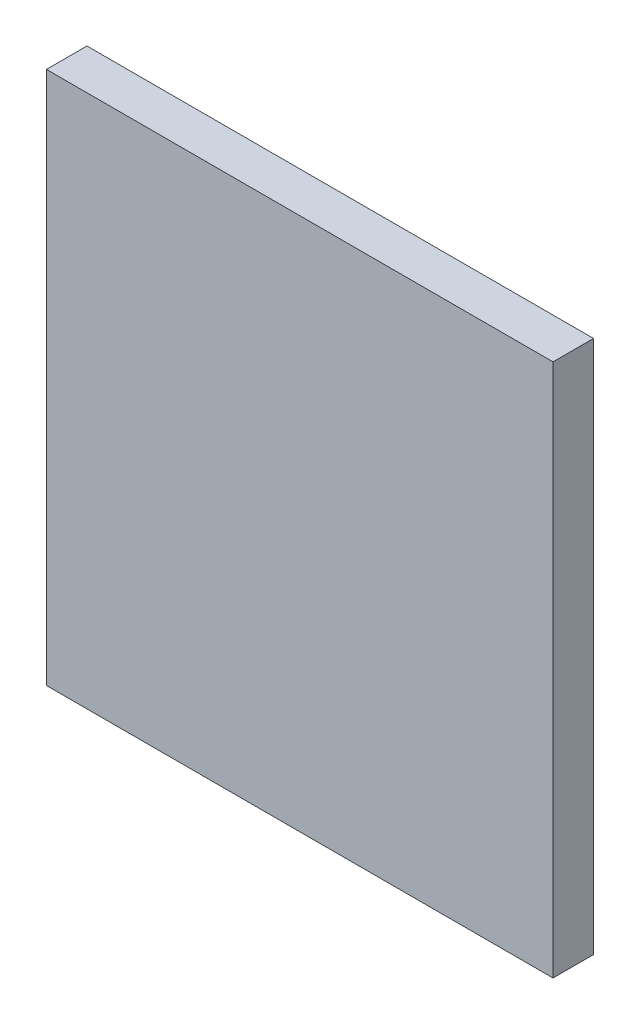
ISO-10303-21;
HEADER;
FILE_DESCRIPTION(('STEP AP214'),'2;1');
FILE_NAME('part.step','',(''),(''),'','','');
FILE_SCHEMA(('AUTOMOTIVE_DESIGN { 1 0 10303 214 1 1 1 1 }'));
ENDSEC;
DATA;
#1=APPLICATION_CONTEXT('core data for automotive mechanical design processes');
#2=APPLICATION_PROTOCOL_DEFINITION('international standard','automotive_design',2000,#1);
#3=PRODUCT_CONTEXT('',#1,'mechanical');
#4=PRODUCT('Part','Part','',(#3));
#5=PRODUCT_RELATED_PRODUCT_CATEGORY('part','',(#4));
#6=PRODUCT_DEFINITION_FORMATION('','',#4);
#7=PRODUCT_DEFINITION_CONTEXT('part definition',#1,'design');
#8=PRODUCT_DEFINITION('design','',#6,#7);
#9=PRODUCT_DEFINITION_SHAPE('','',#8);
#10=(LENGTH_UNIT() NAMED_UNIT(*) SI_UNIT(.MILLI.,.METRE.));
#11=(NAMED_UNIT(*) PLANE_ANGLE_UNIT() SI_UNIT($,.RADIAN.));
#12=(NAMED_UNIT(*) SI_UNIT($,.STERADIAN.) SOLID_ANGLE_UNIT());
#13=UNCERTAINTY_MEASURE_WITH_UNIT(LENGTH_MEASURE(1.E-05),#10,'distance_accuracy_value','');
#14=(GEOMETRIC_REPRESENTATION_CONTEXT(3) GLOBAL_UNCERTAINTY_ASSIGNED_CONTEXT((#13)) GLOBAL_UNIT_ASSIGNED_CONTEXT((#10,
#11,#12)) REPRESENTATION_CONTEXT('',''));
#15=CARTESIAN_POINT('',(0.,0.,0.));
#16=DIRECTION('',(0.,0.,1.));
#17=DIRECTION('',(1.,0.,0.));
#18=AXIS2_PLACEMENT_3D('',#15,#16,#17);
#19=CARTESIAN_POINT('',(0.,0.,12.));
#20=DIRECTION('',(0.,0.,1.));
#21=DIRECTION('',(1.,0.,0.));
#22=AXIS2_PLACEMENT_3D('',#19,#20,#21);
#23=PLANE('',#22);
#24=DIRECTION('',(1.,0.,0.));
#25=VECTOR('',#24,1.);
#26=CARTESIAN_POINT('',(-75.,-79.,12.));
#27=LINE('',#26,#25);
#28=CARTESIAN_POINT('',(-75.,-79.,12.));
#29=VERTEX_POINT('',#28);
#30=CARTESIAN_POINT('',(75.,-79.,12.));
#31=VERTEX_POINT('',#30);
#32=EDGE_CURVE('E81',#29,#31,#27,.T.);
#33=ORIENTED_EDGE('',*,*,#32,.T.);
#34=DIRECTION('',(0.,1.,0.));
#35=VECTOR('',#34,1.);
#36=CARTESIAN_POINT('',(75.,-79.,12.));
#37=LINE('',#36,#35);
#38=CARTESIAN_POINT('',(75.,79.,12.));
#39=VERTEX_POINT('',#38);
#40=EDGE_CURVE('E99',#31,#39,#37,.T.);
#41=ORIENTED_EDGE('',*,*,#40,.T.);
#42=DIRECTION('',(-1.,0.,0.));
#43=VECTOR('',#42,1.);
#44=CARTESIAN_POINT('',(75.,79.,12.));
#45=LINE('',#44,#43);
#46=CARTESIAN_POINT('',(-75.,79.,12.));
#47=VERTEX_POINT('',#46);
#48=EDGE_CURVE('E74',#39,#47,#45,.T.);
#49=ORIENTED_EDGE('',*,*,#48,.T.);
#50=DIRECTION('',(0.,-1.,0.));
#51=VECTOR('',#50,1.);
#52=CARTESIAN_POINT('',(-75.,79.,12.));
#53=LINE('',#52,#51);
#54=EDGE_CURVE('E10',#47,#29,#53,.T.);
#55=ORIENTED_EDGE('',*,*,#54,.T.);
#56=EDGE_LOOP('',(#33,#41,#49,#55));
#57=FACE_BOUND('',#56,.T.);
#58=ADVANCED_FACE('F16',(#57),#23,.T.);
#59=CARTESIAN_POINT('',(0.,0.,0.));
#60=DIRECTION('',(0.,0.,1.));
#61=DIRECTION('',(1.,0.,0.));
#62=AXIS2_PLACEMENT_3D('',#59,#60,#61);
#63=PLANE('',#62);
#64=DIRECTION('',(0.,-1.,0.));
#65=VECTOR('',#64,1.);
#66=CARTESIAN_POINT('',(-75.,79.,0.));
#67=LINE('',#66,#65);
#68=CARTESIAN_POINT('',(-75.,79.,0.));
#69=VERTEX_POINT('',#68);
#70=CARTESIAN_POINT('',(-75.,-79.,0.));
#71=VERTEX_POINT('',#70);
#72=EDGE_CURVE('E19',#69,#71,#67,.T.);
#73=ORIENTED_EDGE('',*,*,#72,.F.);
#74=DIRECTION('',(-1.,0.,0.));
#75=VECTOR('',#74,1.);
#76=CARTESIAN_POINT('',(75.,79.,0.));
#77=LINE('',#76,#75);
#78=CARTESIAN_POINT('',(75.,79.,0.));
#79=VERTEX_POINT('',#78);
#80=EDGE_CURVE('E103',#79,#69,#77,.T.);
#81=ORIENTED_EDGE('',*,*,#80,.F.);
#82=DIRECTION('',(0.,1.,0.));
#83=VECTOR('',#82,1.);
#84=CARTESIAN_POINT('',(75.,-79.,0.));
#85=LINE('',#84,#83);
#86=CARTESIAN_POINT('',(75.,-79.,0.));
#87=VERTEX_POINT('',#86);
#88=EDGE_CURVE('E83',#87,#79,#85,.T.);
#89=ORIENTED_EDGE('',*,*,#88,.F.);
#90=DIRECTION('',(1.,0.,0.));
#91=VECTOR('',#90,1.);
#92=CARTESIAN_POINT('',(-75.,-79.,0.));
#93=LINE('',#92,#91);
#94=EDGE_CURVE('E79',#71,#87,#93,.T.);
#95=ORIENTED_EDGE('',*,*,#94,.F.);
#96=EDGE_LOOP('',(#73,#81,#89,#95));
#97=FACE_BOUND('',#96,.T.);
#98=ADVANCED_FACE('F85',(#97),#63,.F.);
#99=CARTESIAN_POINT('',(-75.,79.,0.));
#100=DIRECTION('',(1.,0.,0.));
#101=DIRECTION('',(0.,1.,0.));
#102=AXIS2_PLACEMENT_3D('',#99,#100,#101);
#103=PLANE('',#102);
#104=ORIENTED_EDGE('',*,*,#72,.T.);
#105=DIRECTION('',(0.,0.,1.));
#106=VECTOR('',#105,1.);
#107=CARTESIAN_POINT('',(-75.,-79.,0.));
#108=LINE('',#107,#106);
#109=EDGE_CURVE('E68',#71,#29,#108,.T.);
#110=ORIENTED_EDGE('',*,*,#109,.T.);
#111=ORIENTED_EDGE('',*,*,#54,.F.);
#112=DIRECTION('',(0.,0.,1.));
#113=VECTOR('',#112,1.);
#114=CARTESIAN_POINT('',(-75.,79.,0.));
#115=LINE('',#114,#113);
#116=EDGE_CURVE('E71',#69,#47,#115,.T.);
#117=ORIENTED_EDGE('',*,*,#116,.F.);
#118=EDGE_LOOP('',(#104,#110,#111,#117));
#119=FACE_BOUND('',#118,.T.);
#120=ADVANCED_FACE('F67',(#119),#103,.F.);
#121=CARTESIAN_POINT('',(75.,79.,0.));
#122=DIRECTION('',(0.,-1.,0.));
#123=DIRECTION('',(0.,0.,-1.));
#124=AXIS2_PLACEMENT_3D('',#121,#122,#123);
#125=PLANE('',#124);
#126=ORIENTED_EDGE('',*,*,#80,.T.);
#127=ORIENTED_EDGE('',*,*,#116,.T.);
#128=ORIENTED_EDGE('',*,*,#48,.F.);
#129=DIRECTION('',(0.,0.,1.));
#130=VECTOR('',#129,1.);
#131=CARTESIAN_POINT('',(75.,79.,0.));
#132=LINE('',#131,#130);
#133=EDGE_CURVE('E104',#79,#39,#132,.T.);
#134=ORIENTED_EDGE('',*,*,#133,.F.);
#135=EDGE_LOOP('',(#126,#127,#128,#134));
#136=FACE_BOUND('',#135,.T.);
#137=ADVANCED_FACE('F116',(#136),#125,.F.);
#138=CARTESIAN_POINT('',(75.,-79.,0.));
#139=DIRECTION('',(-1.,0.,0.));
#140=DIRECTION('',(0.,0.,1.));
#141=AXIS2_PLACEMENT_3D('',#138,#139,#140);
#142=PLANE('',#141);
#143=ORIENTED_EDGE('',*,*,#88,.T.);
#144=ORIENTED_EDGE('',*,*,#133,.T.);
#145=ORIENTED_EDGE('',*,*,#40,.F.);
#146=DIRECTION('',(0.,0.,1.));
#147=VECTOR('',#146,1.);
#148=CARTESIAN_POINT('',(75.,-79.,0.));
#149=LINE('',#148,#147);
#150=EDGE_CURVE('E89',#87,#31,#149,.T.);
#151=ORIENTED_EDGE('',*,*,#150,.F.);
#152=EDGE_LOOP('',(#143,#144,#145,#151));
#153=FACE_BOUND('',#152,.T.);
#154=ADVANCED_FACE('F119',(#153),#142,.F.);
#155=CARTESIAN_POINT('',(-75.,-79.,0.));
#156=DIRECTION('',(0.,1.,0.));
#157=DIRECTION('',(1.,0.,0.));
#158=AXIS2_PLACEMENT_3D('',#155,#156,#157);
#159=PLANE('',#158);
#160=ORIENTED_EDGE('',*,*,#94,.T.);
#161=ORIENTED_EDGE('',*,*,#150,.T.);
#162=ORIENTED_EDGE('',*,*,#32,.F.);
#163=ORIENTED_EDGE('',*,*,#109,.F.);
#164=EDGE_LOOP('',(#160,#161,#162,#163));
#165=FACE_BOUND('',#164,.T.);
#166=ADVANCED_FACE('F77',(#165),#159,.F.);
#167=CLOSED_SHELL('',(#58,#98,#120,#137,#154,#166));
#168=MANIFOLD_SOLID_BREP('B1',#167);
#169=ADVANCED_BREP_SHAPE_REPRESENTATION('',(#18,#168),#14);
#170=SHAPE_DEFINITION_REPRESENTATION(#9,#169);
ENDSEC;
END-ISO-10303-21;
